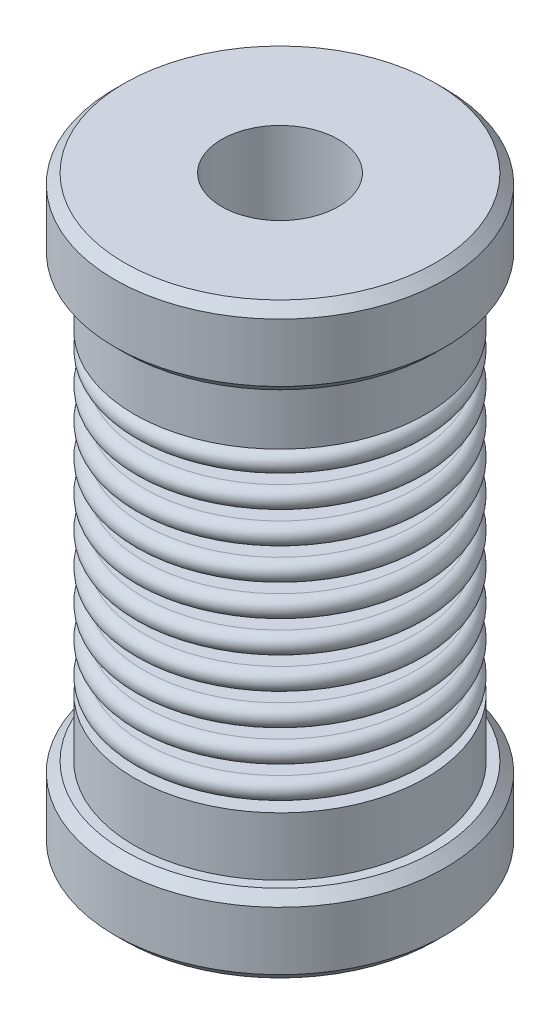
ISO-10303-21;
HEADER;
FILE_DESCRIPTION(('STEP AP214'),'2;1');
FILE_NAME('part.step','',(''),(''),'','','');
FILE_SCHEMA(('AUTOMOTIVE_DESIGN { 1 0 10303 214 1 1 1 1 }'));
ENDSEC;
DATA;
#1=APPLICATION_CONTEXT('core data for automotive mechanical design processes');
#2=APPLICATION_PROTOCOL_DEFINITION('international standard','automotive_design',2000,#1);
#3=PRODUCT_CONTEXT('',#1,'mechanical');
#4=PRODUCT('Part','Part','',(#3));
#5=PRODUCT_RELATED_PRODUCT_CATEGORY('part','',(#4));
#6=PRODUCT_DEFINITION_FORMATION('','',#4);
#7=PRODUCT_DEFINITION_CONTEXT('part definition',#1,'design');
#8=PRODUCT_DEFINITION('design','',#6,#7);
#9=PRODUCT_DEFINITION_SHAPE('','',#8);
#10=(LENGTH_UNIT() NAMED_UNIT(*) SI_UNIT(.MILLI.,.METRE.));
#11=(NAMED_UNIT(*) PLANE_ANGLE_UNIT() SI_UNIT($,.RADIAN.));
#12=(NAMED_UNIT(*) SI_UNIT($,.STERADIAN.) SOLID_ANGLE_UNIT());
#13=UNCERTAINTY_MEASURE_WITH_UNIT(LENGTH_MEASURE(1.E-05),#10,'distance_accuracy_value','');
#14=(GEOMETRIC_REPRESENTATION_CONTEXT(3) GLOBAL_UNCERTAINTY_ASSIGNED_CONTEXT((#13)) GLOBAL_UNIT_ASSIGNED_CONTEXT((#10,
#11,#12)) REPRESENTATION_CONTEXT('',''));
#15=CARTESIAN_POINT('',(0.,0.,0.));
#16=DIRECTION('',(0.,0.,1.));
#17=DIRECTION('',(1.,0.,0.));
#18=AXIS2_PLACEMENT_3D('',#15,#16,#17);
#19=CARTESIAN_POINT('',(0.,-34.7878737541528,0.));
#20=DIRECTION('',(0.,-1.,0.));
#21=DIRECTION('',(0.,0.,-1.));
#22=AXIS2_PLACEMENT_3D('',#19,#20,#21);
#23=CYLINDRICAL_SURFACE('',#22,5.5);
#24=CARTESIAN_POINT('',(0.,-21.27,0.));
#25=DIRECTION('',(0.,1.,0.));
#26=DIRECTION('',(0.,0.,1.));
#27=AXIS2_PLACEMENT_3D('',#24,#25,#26);
#28=CIRCLE('',#27,5.5);
#29=CARTESIAN_POINT('',(0.,-21.27,5.5));
#30=VERTEX_POINT('',#29);
#31=EDGE_CURVE('E184',#30,#30,#28,.T.);
#32=ORIENTED_EDGE('',*,*,#31,.F.);
#33=EDGE_LOOP('',(#32));
#34=FACE_BOUND('',#33,.T.);
#35=CARTESIAN_POINT('',(0.,-21.8900000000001,0.));
#36=DIRECTION('',(0.,1.,0.));
#37=DIRECTION('',(0.,0.,1.));
#38=AXIS2_PLACEMENT_3D('',#35,#36,#37);
#39=CIRCLE('',#38,5.5);
#40=CARTESIAN_POINT('',(0.,-21.8900000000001,5.5));
#41=VERTEX_POINT('',#40);
#42=EDGE_CURVE('E199',#41,#41,#39,.T.);
#43=ORIENTED_EDGE('',*,*,#42,.T.);
#44=EDGE_LOOP('',(#43));
#45=FACE_BOUND('',#44,.T.);
#46=ADVANCED_FACE('F26',(#34,#45),#23,.T.);
#47=CARTESIAN_POINT('',(0.,-23.2,0.));
#48=DIRECTION('',(0.,-1.,0.));
#49=DIRECTION('',(0.,0.,-1.));
#50=AXIS2_PLACEMENT_3D('',#47,#48,#49);
#51=CIRCLE('',#50,5.5);
#52=CARTESIAN_POINT('',(0.,-23.2,-5.5));
#53=VERTEX_POINT('',#52);
#54=EDGE_CURVE('E70',#53,#53,#51,.T.);
#55=ORIENTED_EDGE('',*,*,#54,.F.);
#56=EDGE_LOOP('',(#55));
#57=FACE_BOUND('',#56,.T.);
#58=CARTESIAN_POINT('',(0.,-22.8900000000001,0.));
#59=DIRECTION('',(0.,1.,0.));
#60=DIRECTION('',(0.,0.,1.));
#61=AXIS2_PLACEMENT_3D('',#58,#59,#60);
#62=CIRCLE('',#61,5.5);
#63=CARTESIAN_POINT('',(0.,-22.8900000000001,5.5));
#64=VERTEX_POINT('',#63);
#65=EDGE_CURVE('E196',#64,#64,#62,.T.);
#66=ORIENTED_EDGE('',*,*,#65,.F.);
#67=EDGE_LOOP('',(#66));
#68=FACE_BOUND('',#67,.T.);
#69=ADVANCED_FACE('F224',(#57,#68),#23,.T.);
#70=CARTESIAN_POINT('',(0.,-19.6500000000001,0.));
#71=DIRECTION('',(0.,1.,0.));
#72=DIRECTION('',(0.,0.,1.));
#73=AXIS2_PLACEMENT_3D('',#70,#71,#72);
#74=CIRCLE('',#73,5.5);
#75=CARTESIAN_POINT('',(0.,-19.6500000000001,5.5));
#76=VERTEX_POINT('',#75);
#77=EDGE_CURVE('E172',#76,#76,#74,.T.);
#78=ORIENTED_EDGE('',*,*,#77,.F.);
#79=EDGE_LOOP('',(#78));
#80=FACE_BOUND('',#79,.T.);
#81=CARTESIAN_POINT('',(0.,-20.27,0.));
#82=DIRECTION('',(0.,1.,0.));
#83=DIRECTION('',(0.,0.,1.));
#84=AXIS2_PLACEMENT_3D('',#81,#82,#83);
#85=CIRCLE('',#84,5.5);
#86=CARTESIAN_POINT('',(0.,-20.27,5.5));
#87=VERTEX_POINT('',#86);
#88=EDGE_CURVE('E187',#87,#87,#85,.T.);
#89=ORIENTED_EDGE('',*,*,#88,.T.);
#90=EDGE_LOOP('',(#89));
#91=FACE_BOUND('',#90,.T.);
#92=ADVANCED_FACE('F226',(#80,#91),#23,.T.);
#93=CARTESIAN_POINT('',(0.,-18.03,0.));
#94=DIRECTION('',(0.,1.,0.));
#95=DIRECTION('',(0.,0.,1.));
#96=AXIS2_PLACEMENT_3D('',#93,#94,#95);
#97=CIRCLE('',#96,5.5);
#98=CARTESIAN_POINT('',(0.,-18.03,5.5));
#99=VERTEX_POINT('',#98);
#100=EDGE_CURVE('E160',#99,#99,#97,.T.);
#101=ORIENTED_EDGE('',*,*,#100,.F.);
#102=EDGE_LOOP('',(#101));
#103=FACE_BOUND('',#102,.T.);
#104=CARTESIAN_POINT('',(0.,-18.6500000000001,0.));
#105=DIRECTION('',(0.,1.,0.));
#106=DIRECTION('',(0.,0.,1.));
#107=AXIS2_PLACEMENT_3D('',#104,#105,#106);
#108=CIRCLE('',#107,5.5);
#109=CARTESIAN_POINT('',(0.,-18.6500000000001,5.5));
#110=VERTEX_POINT('',#109);
#111=EDGE_CURVE('E175',#110,#110,#108,.T.);
#112=ORIENTED_EDGE('',*,*,#111,.T.);
#113=EDGE_LOOP('',(#112));
#114=FACE_BOUND('',#113,.T.);
#115=ADVANCED_FACE('F233',(#103,#114),#23,.T.);
#116=CARTESIAN_POINT('',(0.,-16.41,0.));
#117=DIRECTION('',(0.,1.,0.));
#118=DIRECTION('',(0.,0.,1.));
#119=AXIS2_PLACEMENT_3D('',#116,#117,#118);
#120=CIRCLE('',#119,5.5);
#121=CARTESIAN_POINT('',(0.,-16.41,5.5));
#122=VERTEX_POINT('',#121);
#123=EDGE_CURVE('E148',#122,#122,#120,.T.);
#124=ORIENTED_EDGE('',*,*,#123,.F.);
#125=EDGE_LOOP('',(#124));
#126=FACE_BOUND('',#125,.T.);
#127=CARTESIAN_POINT('',(0.,-17.03,0.));
#128=DIRECTION('',(0.,1.,0.));
#129=DIRECTION('',(0.,0.,1.));
#130=AXIS2_PLACEMENT_3D('',#127,#128,#129);
#131=CIRCLE('',#130,5.5);
#132=CARTESIAN_POINT('',(0.,-17.03,5.5));
#133=VERTEX_POINT('',#132);
#134=EDGE_CURVE('E163',#133,#133,#131,.T.);
#135=ORIENTED_EDGE('',*,*,#134,.T.);
#136=EDGE_LOOP('',(#135));
#137=FACE_BOUND('',#136,.T.);
#138=ADVANCED_FACE('F318',(#126,#137),#23,.T.);
#139=CARTESIAN_POINT('',(0.,-14.7900000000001,0.));
#140=DIRECTION('',(0.,1.,0.));
#141=DIRECTION('',(0.,0.,1.));
#142=AXIS2_PLACEMENT_3D('',#139,#140,#141);
#143=CIRCLE('',#142,5.5);
#144=CARTESIAN_POINT('',(0.,-14.7900000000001,5.5));
#145=VERTEX_POINT('',#144);
#146=EDGE_CURVE('E136',#145,#145,#143,.T.);
#147=ORIENTED_EDGE('',*,*,#146,.F.);
#148=EDGE_LOOP('',(#147));
#149=FACE_BOUND('',#148,.T.);
#150=CARTESIAN_POINT('',(0.,-15.41,0.));
#151=DIRECTION('',(0.,1.,0.));
#152=DIRECTION('',(0.,0.,1.));
#153=AXIS2_PLACEMENT_3D('',#150,#151,#152);
#154=CIRCLE('',#153,5.5);
#155=CARTESIAN_POINT('',(0.,-15.41,5.5));
#156=VERTEX_POINT('',#155);
#157=EDGE_CURVE('E151',#156,#156,#154,.T.);
#158=ORIENTED_EDGE('',*,*,#157,.T.);
#159=EDGE_LOOP('',(#158));
#160=FACE_BOUND('',#159,.T.);
#161=ADVANCED_FACE('F311',(#149,#160),#23,.T.);
#162=CARTESIAN_POINT('',(0.,-13.17,0.));
#163=DIRECTION('',(0.,1.,0.));
#164=DIRECTION('',(0.,0.,1.));
#165=AXIS2_PLACEMENT_3D('',#162,#163,#164);
#166=CIRCLE('',#165,5.5);
#167=CARTESIAN_POINT('',(0.,-13.17,5.5));
#168=VERTEX_POINT('',#167);
#169=EDGE_CURVE('E124',#168,#168,#166,.T.);
#170=ORIENTED_EDGE('',*,*,#169,.F.);
#171=EDGE_LOOP('',(#170));
#172=FACE_BOUND('',#171,.T.);
#173=CARTESIAN_POINT('',(0.,-13.7900000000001,0.));
#174=DIRECTION('',(0.,1.,0.));
#175=DIRECTION('',(0.,0.,1.));
#176=AXIS2_PLACEMENT_3D('',#173,#174,#175);
#177=CIRCLE('',#176,5.5);
#178=CARTESIAN_POINT('',(0.,-13.7900000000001,5.5));
#179=VERTEX_POINT('',#178);
#180=EDGE_CURVE('E139',#179,#179,#177,.T.);
#181=ORIENTED_EDGE('',*,*,#180,.T.);
#182=EDGE_LOOP('',(#181));
#183=FACE_BOUND('',#182,.T.);
#184=ADVANCED_FACE('F304',(#172,#183),#23,.T.);
#185=CARTESIAN_POINT('',(0.,-11.5500000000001,0.));
#186=DIRECTION('',(0.,1.,0.));
#187=DIRECTION('',(0.,0.,1.));
#188=AXIS2_PLACEMENT_3D('',#185,#186,#187);
#189=CIRCLE('',#188,5.5);
#190=CARTESIAN_POINT('',(0.,-11.5500000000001,5.5));
#191=VERTEX_POINT('',#190);
#192=EDGE_CURVE('E112',#191,#191,#189,.T.);
#193=ORIENTED_EDGE('',*,*,#192,.F.);
#194=EDGE_LOOP('',(#193));
#195=FACE_BOUND('',#194,.T.);
#196=CARTESIAN_POINT('',(0.,-12.17,0.));
#197=DIRECTION('',(0.,1.,0.));
#198=DIRECTION('',(0.,0.,1.));
#199=AXIS2_PLACEMENT_3D('',#196,#197,#198);
#200=CIRCLE('',#199,5.5);
#201=CARTESIAN_POINT('',(0.,-12.17,5.5));
#202=VERTEX_POINT('',#201);
#203=EDGE_CURVE('E127',#202,#202,#200,.T.);
#204=ORIENTED_EDGE('',*,*,#203,.T.);
#205=EDGE_LOOP('',(#204));
#206=FACE_BOUND('',#205,.T.);
#207=ADVANCED_FACE('F297',(#195,#206),#23,.T.);
#208=CARTESIAN_POINT('',(0.,-9.92999999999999,0.));
#209=DIRECTION('',(0.,1.,0.));
#210=DIRECTION('',(0.,0.,1.));
#211=AXIS2_PLACEMENT_3D('',#208,#209,#210);
#212=CIRCLE('',#211,5.5);
#213=CARTESIAN_POINT('',(0.,-9.92999999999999,5.5));
#214=VERTEX_POINT('',#213);
#215=EDGE_CURVE('E100',#214,#214,#212,.T.);
#216=ORIENTED_EDGE('',*,*,#215,.F.);
#217=EDGE_LOOP('',(#216));
#218=FACE_BOUND('',#217,.T.);
#219=CARTESIAN_POINT('',(0.,-10.5500000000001,0.));
#220=DIRECTION('',(0.,1.,0.));
#221=DIRECTION('',(0.,0.,1.));
#222=AXIS2_PLACEMENT_3D('',#219,#220,#221);
#223=CIRCLE('',#222,5.5);
#224=CARTESIAN_POINT('',(0.,-10.5500000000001,5.5));
#225=VERTEX_POINT('',#224);
#226=EDGE_CURVE('E115',#225,#225,#223,.T.);
#227=ORIENTED_EDGE('',*,*,#226,.T.);
#228=EDGE_LOOP('',(#227));
#229=FACE_BOUND('',#228,.T.);
#230=ADVANCED_FACE('F289',(#218,#229),#23,.T.);
#231=CARTESIAN_POINT('',(0.,-8.31000000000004,0.));
#232=DIRECTION('',(0.,1.,0.));
#233=DIRECTION('',(0.,0.,1.));
#234=AXIS2_PLACEMENT_3D('',#231,#232,#233);
#235=CIRCLE('',#234,5.5);
#236=CARTESIAN_POINT('',(0.,-8.31000000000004,5.5));
#237=VERTEX_POINT('',#236);
#238=EDGE_CURVE('E88',#237,#237,#235,.T.);
#239=ORIENTED_EDGE('',*,*,#238,.F.);
#240=EDGE_LOOP('',(#239));
#241=FACE_BOUND('',#240,.T.);
#242=CARTESIAN_POINT('',(0.,-8.92999999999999,0.));
#243=DIRECTION('',(0.,1.,0.));
#244=DIRECTION('',(0.,0.,1.));
#245=AXIS2_PLACEMENT_3D('',#242,#243,#244);
#246=CIRCLE('',#245,5.5);
#247=CARTESIAN_POINT('',(0.,-8.92999999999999,5.5));
#248=VERTEX_POINT('',#247);
#249=EDGE_CURVE('E103',#248,#248,#246,.T.);
#250=ORIENTED_EDGE('',*,*,#249,.T.);
#251=EDGE_LOOP('',(#250));
#252=FACE_BOUND('',#251,.T.);
#253=ADVANCED_FACE('F241',(#241,#252),#23,.T.);
#254=CARTESIAN_POINT('',(0.,-7.00000000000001,0.));
#255=DIRECTION('',(0.,-1.,0.));
#256=DIRECTION('',(0.,0.,-1.));
#257=AXIS2_PLACEMENT_3D('',#254,#255,#256);
#258=CIRCLE('',#257,5.5);
#259=CARTESIAN_POINT('',(0.,-7.00000000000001,-5.5));
#260=VERTEX_POINT('',#259);
#261=EDGE_CURVE('E73',#260,#260,#258,.T.);
#262=ORIENTED_EDGE('',*,*,#261,.T.);
#263=EDGE_LOOP('',(#262));
#264=FACE_BOUND('',#263,.T.);
#265=CARTESIAN_POINT('',(0.,-7.31000000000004,0.));
#266=DIRECTION('',(0.,1.,0.));
#267=DIRECTION('',(0.,0.,1.));
#268=AXIS2_PLACEMENT_3D('',#265,#266,#267);
#269=CIRCLE('',#268,5.5);
#270=CARTESIAN_POINT('',(0.,-7.31000000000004,5.5));
#271=VERTEX_POINT('',#270);
#272=EDGE_CURVE('E91',#271,#271,#269,.T.);
#273=ORIENTED_EDGE('',*,*,#272,.T.);
#274=EDGE_LOOP('',(#273));
#275=FACE_BOUND('',#274,.T.);
#276=ADVANCED_FACE('F236',(#264,#275),#23,.T.);
#277=CARTESIAN_POINT('',(8.50000000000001,0.,0.));
#278=DIRECTION('',(0.,1.,0.));
#279=DIRECTION('',(0.,0.,1.));
#280=AXIS2_PLACEMENT_3D('',#277,#278,#279);
#281=PLANE('',#280);
#282=CARTESIAN_POINT('',(0.,0.,0.));
#283=DIRECTION('',(0.,1.,0.));
#284=DIRECTION('',(0.,0.,1.));
#285=AXIS2_PLACEMENT_3D('',#282,#283,#284);
#286=CIRCLE('',#285,8.);
#287=CARTESIAN_POINT('',(0.,0.,8.));
#288=VERTEX_POINT('',#287);
#289=EDGE_CURVE('E10',#288,#288,#286,.T.);
#290=ORIENTED_EDGE('',*,*,#289,.T.);
#291=EDGE_LOOP('',(#290));
#292=FACE_BOUND('',#291,.T.);
#293=CARTESIAN_POINT('',(0.,0.,0.));
#294=DIRECTION('',(0.,-1.,0.));
#295=DIRECTION('',(0.,0.,-1.));
#296=AXIS2_PLACEMENT_3D('',#293,#294,#295);
#297=CIRCLE('',#296,3.);
#298=CARTESIAN_POINT('',(0.,0.,-3.));
#299=VERTEX_POINT('',#298);
#300=EDGE_CURVE('E58',#299,#299,#297,.T.);
#301=ORIENTED_EDGE('',*,*,#300,.T.);
#302=EDGE_LOOP('',(#301));
#303=FACE_BOUND('',#302,.T.);
#304=ADVANCED_FACE('F28',(#292,#303),#281,.T.);
#305=CARTESIAN_POINT('',(0.,-34.7878737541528,0.));
#306=DIRECTION('',(0.,-1.,0.));
#307=DIRECTION('',(0.,0.,-1.));
#308=AXIS2_PLACEMENT_3D('',#305,#306,#307);
#309=CYLINDRICAL_SURFACE('',#308,3.);
#310=CARTESIAN_POINT('',(0.,-30.2,0.));
#311=DIRECTION('',(0.,-1.,0.));
#312=DIRECTION('',(0.,0.,-1.));
#313=AXIS2_PLACEMENT_3D('',#310,#311,#312);
#314=CIRCLE('',#313,3.);
#315=CARTESIAN_POINT('',(0.,-30.2,-3.));
#316=VERTEX_POINT('',#315);
#317=EDGE_CURVE('E61',#316,#316,#314,.T.);
#318=ORIENTED_EDGE('',*,*,#317,.T.);
#319=EDGE_LOOP('',(#318));
#320=FACE_BOUND('',#319,.T.);
#321=ORIENTED_EDGE('',*,*,#300,.F.);
#322=EDGE_LOOP('',(#321));
#323=FACE_BOUND('',#322,.T.);
#324=ADVANCED_FACE('F263',(#320,#323),#309,.F.);
#325=CARTESIAN_POINT('',(3.,-30.2,0.));
#326=DIRECTION('',(0.,-1.,0.));
#327=DIRECTION('',(0.,0.,-1.));
#328=AXIS2_PLACEMENT_3D('',#325,#326,#327);
#329=PLANE('',#328);
#330=CARTESIAN_POINT('',(0.,-30.2,0.));
#331=DIRECTION('',(0.,-1.,0.));
#332=DIRECTION('',(0.,0.,-1.));
#333=AXIS2_PLACEMENT_3D('',#330,#331,#332);
#334=CIRCLE('',#333,7.99999999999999);
#335=CARTESIAN_POINT('',(0.,-30.2,-7.99999999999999));
#336=VERTEX_POINT('',#335);
#337=EDGE_CURVE('E55',#336,#336,#334,.T.);
#338=ORIENTED_EDGE('',*,*,#337,.T.);
#339=EDGE_LOOP('',(#338));
#340=FACE_BOUND('',#339,.T.);
#341=ORIENTED_EDGE('',*,*,#317,.F.);
#342=EDGE_LOOP('',(#341));
#343=FACE_BOUND('',#342,.T.);
#344=ADVANCED_FACE('F260',(#340,#343),#329,.T.);
#345=CARTESIAN_POINT('',(0.,-34.7878737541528,0.));
#346=DIRECTION('',(0.,-1.,0.));
#347=DIRECTION('',(0.,0.,-1.));
#348=AXIS2_PLACEMENT_3D('',#345,#346,#347);
#349=CYLINDRICAL_SURFACE('',#348,8.5);
#350=CARTESIAN_POINT('',(0.,-29.7,0.));
#351=DIRECTION('',(0.,-1.,0.));
#352=DIRECTION('',(0.,0.,-1.));
#353=AXIS2_PLACEMENT_3D('',#350,#351,#352);
#354=CIRCLE('',#353,8.5);
#355=CARTESIAN_POINT('',(0.,-29.7,-8.5));
#356=VERTEX_POINT('',#355);
#357=EDGE_CURVE('E49',#356,#356,#354,.F.);
#358=ORIENTED_EDGE('',*,*,#357,.T.);
#359=EDGE_LOOP('',(#358));
#360=FACE_BOUND('',#359,.T.);
#361=CARTESIAN_POINT('',(0.,-26.7000000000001,0.));
#362=DIRECTION('',(0.,1.,0.));
#363=DIRECTION('',(0.,0.,1.));
#364=AXIS2_PLACEMENT_3D('',#361,#362,#363);
#365=CIRCLE('',#364,8.5);
#366=CARTESIAN_POINT('',(0.,-26.7000000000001,8.5));
#367=VERTEX_POINT('',#366);
#368=EDGE_CURVE('E52',#367,#367,#365,.F.);
#369=ORIENTED_EDGE('',*,*,#368,.T.);
#370=EDGE_LOOP('',(#369));
#371=FACE_BOUND('',#370,.T.);
#372=ADVANCED_FACE('F256',(#360,#371),#349,.T.);
#373=CARTESIAN_POINT('',(8.50000000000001,-26.2,0.));
#374=DIRECTION('',(0.,1.,0.));
#375=DIRECTION('',(0.,0.,1.));
#376=AXIS2_PLACEMENT_3D('',#373,#374,#375);
#377=PLANE('',#376);
#378=CARTESIAN_POINT('',(0.,-26.2,0.));
#379=DIRECTION('',(0.,1.,0.));
#380=DIRECTION('',(0.,0.,1.));
#381=AXIS2_PLACEMENT_3D('',#378,#379,#380);
#382=CIRCLE('',#381,8.);
#383=CARTESIAN_POINT('',(0.,-26.2,8.));
#384=VERTEX_POINT('',#383);
#385=EDGE_CURVE('E46',#384,#384,#382,.T.);
#386=ORIENTED_EDGE('',*,*,#385,.T.);
#387=EDGE_LOOP('',(#386));
#388=FACE_BOUND('',#387,.T.);
#389=CARTESIAN_POINT('',(0.,-26.2,0.));
#390=DIRECTION('',(0.,-1.,0.));
#391=DIRECTION('',(0.,0.,-1.));
#392=AXIS2_PLACEMENT_3D('',#389,#390,#391);
#393=CIRCLE('',#392,7.5);
#394=CARTESIAN_POINT('',(0.,-26.2,-7.5));
#395=VERTEX_POINT('',#394);
#396=EDGE_CURVE('E64',#395,#395,#393,.T.);
#397=ORIENTED_EDGE('',*,*,#396,.T.);
#398=EDGE_LOOP('',(#397));
#399=FACE_BOUND('',#398,.T.);
#400=ADVANCED_FACE('F252',(#388,#399),#377,.T.);
#401=CARTESIAN_POINT('',(0.,-34.7878737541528,0.));
#402=DIRECTION('',(0.,-1.,0.));
#403=DIRECTION('',(0.,0.,-1.));
#404=AXIS2_PLACEMENT_3D('',#401,#402,#403);
#405=CYLINDRICAL_SURFACE('',#404,7.5);
#406=CARTESIAN_POINT('',(0.,-23.2,0.));
#407=DIRECTION('',(0.,-1.,0.));
#408=DIRECTION('',(0.,0.,-1.));
#409=AXIS2_PLACEMENT_3D('',#406,#407,#408);
#410=CIRCLE('',#409,7.5);
#411=CARTESIAN_POINT('',(0.,-23.2,-7.5));
#412=VERTEX_POINT('',#411);
#413=EDGE_CURVE('E67',#412,#412,#410,.T.);
#414=ORIENTED_EDGE('',*,*,#413,.T.);
#415=EDGE_LOOP('',(#414));
#416=FACE_BOUND('',#415,.T.);
#417=ORIENTED_EDGE('',*,*,#396,.F.);
#418=EDGE_LOOP('',(#417));
#419=FACE_BOUND('',#418,.T.);
#420=ADVANCED_FACE('F248',(#416,#419),#405,.T.);
#421=CARTESIAN_POINT('',(7.50000000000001,-23.2,0.));
#422=DIRECTION('',(0.,1.,0.));
#423=DIRECTION('',(0.,0.,1.));
#424=AXIS2_PLACEMENT_3D('',#421,#422,#423);
#425=PLANE('',#424);
#426=ORIENTED_EDGE('',*,*,#54,.T.);
#427=EDGE_LOOP('',(#426));
#428=FACE_BOUND('',#427,.T.);
#429=ORIENTED_EDGE('',*,*,#413,.F.);
#430=EDGE_LOOP('',(#429));
#431=FACE_BOUND('',#430,.T.);
#432=ADVANCED_FACE('F245',(#428,#431),#425,.T.);
#433=CARTESIAN_POINT('',(5.50000000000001,-7.00000000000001,0.));
#434=DIRECTION('',(0.,-1.,0.));
#435=DIRECTION('',(0.,0.,-1.));
#436=AXIS2_PLACEMENT_3D('',#433,#434,#435);
#437=PLANE('',#436);
#438=CARTESIAN_POINT('',(0.,-7.00000000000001,0.));
#439=DIRECTION('',(0.,-1.,0.));
#440=DIRECTION('',(0.,0.,-1.));
#441=AXIS2_PLACEMENT_3D('',#438,#439,#440);
#442=CIRCLE('',#441,7.5);
#443=CARTESIAN_POINT('',(0.,-7.00000000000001,-7.5));
#444=VERTEX_POINT('',#443);
#445=EDGE_CURVE('E76',#444,#444,#442,.T.);
#446=ORIENTED_EDGE('',*,*,#445,.T.);
#447=EDGE_LOOP('',(#446));
#448=FACE_BOUND('',#447,.T.);
#449=ORIENTED_EDGE('',*,*,#261,.F.);
#450=EDGE_LOOP('',(#449));
#451=FACE_BOUND('',#450,.T.);
#452=ADVANCED_FACE('F243',(#448,#451),#437,.T.);
#453=CARTESIAN_POINT('',(0.,-34.7878737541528,0.));
#454=DIRECTION('',(0.,-1.,0.));
#455=DIRECTION('',(0.,0.,-1.));
#456=AXIS2_PLACEMENT_3D('',#453,#454,#455);
#457=CYLINDRICAL_SURFACE('',#456,7.5);
#458=CARTESIAN_POINT('',(0.,-4.,0.));
#459=DIRECTION('',(0.,-1.,0.));
#460=DIRECTION('',(0.,0.,-1.));
#461=AXIS2_PLACEMENT_3D('',#458,#459,#460);
#462=CIRCLE('',#461,7.5);
#463=CARTESIAN_POINT('',(0.,-4.,-7.5));
#464=VERTEX_POINT('',#463);
#465=EDGE_CURVE('E79',#464,#464,#462,.T.);
#466=ORIENTED_EDGE('',*,*,#465,.T.);
#467=EDGE_LOOP('',(#466));
#468=FACE_BOUND('',#467,.T.);
#469=ORIENTED_EDGE('',*,*,#445,.F.);
#470=EDGE_LOOP('',(#469));
#471=FACE_BOUND('',#470,.T.);
#472=ADVANCED_FACE('F596',(#468,#471),#457,.T.);
#473=CARTESIAN_POINT('',(7.50000000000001,-4.,0.));
#474=DIRECTION('',(0.,-1.,0.));
#475=DIRECTION('',(0.,0.,-1.));
#476=AXIS2_PLACEMENT_3D('',#473,#474,#475);
#477=PLANE('',#476);
#478=CARTESIAN_POINT('',(0.,-4.,0.));
#479=DIRECTION('',(0.,-1.,0.));
#480=DIRECTION('',(0.,0.,-1.));
#481=AXIS2_PLACEMENT_3D('',#478,#479,#480);
#482=CIRCLE('',#481,8.);
#483=CARTESIAN_POINT('',(0.,-4.,-8.));
#484=VERTEX_POINT('',#483);
#485=EDGE_CURVE('E41',#484,#484,#482,.T.);
#486=ORIENTED_EDGE('',*,*,#485,.T.);
#487=EDGE_LOOP('',(#486));
#488=FACE_BOUND('',#487,.T.);
#489=ORIENTED_EDGE('',*,*,#465,.F.);
#490=EDGE_LOOP('',(#489));
#491=FACE_BOUND('',#490,.T.);
#492=ADVANCED_FACE('F594',(#488,#491),#477,.T.);
#493=CARTESIAN_POINT('',(0.,-34.7878737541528,0.));
#494=DIRECTION('',(0.,-1.,0.));
#495=DIRECTION('',(0.,0.,-1.));
#496=AXIS2_PLACEMENT_3D('',#493,#494,#495);
#497=CYLINDRICAL_SURFACE('',#496,8.5);
#498=CARTESIAN_POINT('',(0.,-3.50000000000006,0.));
#499=DIRECTION('',(0.,-1.,0.));
#500=DIRECTION('',(0.,0.,-1.));
#501=AXIS2_PLACEMENT_3D('',#498,#499,#500);
#502=CIRCLE('',#501,8.5);
#503=CARTESIAN_POINT('',(0.,-3.50000000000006,-8.5));
#504=VERTEX_POINT('',#503);
#505=EDGE_CURVE('E33',#504,#504,#502,.F.);
#506=ORIENTED_EDGE('',*,*,#505,.T.);
#507=EDGE_LOOP('',(#506));
#508=FACE_BOUND('',#507,.T.);
#509=CARTESIAN_POINT('',(0.,-0.499999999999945,0.));
#510=DIRECTION('',(0.,1.,0.));
#511=DIRECTION('',(0.,0.,1.));
#512=AXIS2_PLACEMENT_3D('',#509,#510,#511);
#513=CIRCLE('',#512,8.5);
#514=CARTESIAN_POINT('',(0.,-0.499999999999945,8.5));
#515=VERTEX_POINT('',#514);
#516=EDGE_CURVE('E37',#515,#515,#513,.F.);
#517=ORIENTED_EDGE('',*,*,#516,.T.);
#518=EDGE_LOOP('',(#517));
#519=FACE_BOUND('',#518,.T.);
#520=ADVANCED_FACE('F590',(#508,#519),#497,.T.);
#521=CARTESIAN_POINT('',(0.,-7.31000000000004,-5.5));
#522=DIRECTION('',(0.,-1.,0.));
#523=DIRECTION('',(0.,0.,-1.));
#524=AXIS2_PLACEMENT_3D('',#521,#522,#523);
#525=PLANE('',#524);
#526=ORIENTED_EDGE('',*,*,#272,.F.);
#527=EDGE_LOOP('',(#526));
#528=FACE_BOUND('',#527,.T.);
#529=CARTESIAN_POINT('',(0.,-7.31000000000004,0.));
#530=DIRECTION('',(0.,1.,0.));
#531=DIRECTION('',(0.,0.,1.));
#532=AXIS2_PLACEMENT_3D('',#529,#530,#531);
#533=CIRCLE('',#532,7.);
#534=CARTESIAN_POINT('',(0.,-7.31000000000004,7.));
#535=VERTEX_POINT('',#534);
#536=EDGE_CURVE('E82',#535,#535,#533,.T.);
#537=ORIENTED_EDGE('',*,*,#536,.T.);
#538=EDGE_LOOP('',(#537));
#539=FACE_BOUND('',#538,.T.);
#540=ADVANCED_FACE('F586',(#528,#539),#525,.F.);
#541=CARTESIAN_POINT('',(0.,-7.80999999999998,0.));
#542=DIRECTION('',(0.,1.,0.));
#543=DIRECTION('',(0.,0.,1.));
#544=AXIS2_PLACEMENT_3D('',#541,#542,#543);
#545=TOROIDAL_SURFACE('',#544,7.,0.5);
#546=ORIENTED_EDGE('',*,*,#536,.F.);
#547=EDGE_LOOP('',(#546));
#548=FACE_BOUND('',#547,.T.);
#549=CARTESIAN_POINT('',(0.,-8.31000000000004,0.));
#550=DIRECTION('',(0.,1.,0.));
#551=DIRECTION('',(0.,0.,1.));
#552=AXIS2_PLACEMENT_3D('',#549,#550,#551);
#553=CIRCLE('',#552,7.);
#554=CARTESIAN_POINT('',(0.,-8.31000000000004,7.));
#555=VERTEX_POINT('',#554);
#556=EDGE_CURVE('E85',#555,#555,#553,.T.);
#557=ORIENTED_EDGE('',*,*,#556,.T.);
#558=EDGE_LOOP('',(#557));
#559=FACE_BOUND('',#558,.T.);
#560=ADVANCED_FACE('F582',(#548,#559),#545,.T.);
#561=CARTESIAN_POINT('',(0.,-8.31000000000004,-5.5));
#562=DIRECTION('',(0.,1.,0.));
#563=DIRECTION('',(0.,0.,1.));
#564=AXIS2_PLACEMENT_3D('',#561,#562,#563);
#565=PLANE('',#564);
#566=ORIENTED_EDGE('',*,*,#556,.F.);
#567=EDGE_LOOP('',(#566));
#568=FACE_BOUND('',#567,.T.);
#569=ORIENTED_EDGE('',*,*,#238,.T.);
#570=EDGE_LOOP('',(#569));
#571=FACE_BOUND('',#570,.T.);
#572=ADVANCED_FACE('F350',(#568,#571),#565,.F.);
#573=CARTESIAN_POINT('',(0.,-8.92999999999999,-5.5));
#574=DIRECTION('',(0.,-1.,0.));
#575=DIRECTION('',(0.,0.,-1.));
#576=AXIS2_PLACEMENT_3D('',#573,#574,#575);
#577=PLANE('',#576);
#578=ORIENTED_EDGE('',*,*,#249,.F.);
#579=EDGE_LOOP('',(#578));
#580=FACE_BOUND('',#579,.T.);
#581=CARTESIAN_POINT('',(0.,-8.92999999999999,0.));
#582=DIRECTION('',(0.,1.,0.));
#583=DIRECTION('',(0.,0.,1.));
#584=AXIS2_PLACEMENT_3D('',#581,#582,#583);
#585=CIRCLE('',#584,7.);
#586=CARTESIAN_POINT('',(0.,-8.92999999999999,7.));
#587=VERTEX_POINT('',#586);
#588=EDGE_CURVE('E94',#587,#587,#585,.T.);
#589=ORIENTED_EDGE('',*,*,#588,.T.);
#590=EDGE_LOOP('',(#589));
#591=FACE_BOUND('',#590,.T.);
#592=ADVANCED_FACE('F344',(#580,#591),#577,.F.);
#593=CARTESIAN_POINT('',(0.,-9.43000000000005,0.));
#594=DIRECTION('',(0.,1.,0.));
#595=DIRECTION('',(0.,0.,1.));
#596=AXIS2_PLACEMENT_3D('',#593,#594,#595);
#597=TOROIDAL_SURFACE('',#596,7.,0.5);
#598=ORIENTED_EDGE('',*,*,#588,.F.);
#599=EDGE_LOOP('',(#598));
#600=FACE_BOUND('',#599,.T.);
#601=CARTESIAN_POINT('',(0.,-9.92999999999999,0.));
#602=DIRECTION('',(0.,1.,0.));
#603=DIRECTION('',(0.,0.,1.));
#604=AXIS2_PLACEMENT_3D('',#601,#602,#603);
#605=CIRCLE('',#604,7.);
#606=CARTESIAN_POINT('',(0.,-9.92999999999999,7.));
#607=VERTEX_POINT('',#606);
#608=EDGE_CURVE('E97',#607,#607,#605,.T.);
#609=ORIENTED_EDGE('',*,*,#608,.T.);
#610=EDGE_LOOP('',(#609));
#611=FACE_BOUND('',#610,.T.);
#612=ADVANCED_FACE('F349',(#600,#611),#597,.T.);
#613=CARTESIAN_POINT('',(0.,-9.92999999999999,-5.5));
#614=DIRECTION('',(0.,1.,0.));
#615=DIRECTION('',(0.,0.,1.));
#616=AXIS2_PLACEMENT_3D('',#613,#614,#615);
#617=PLANE('',#616);
#618=ORIENTED_EDGE('',*,*,#608,.F.);
#619=EDGE_LOOP('',(#618));
#620=FACE_BOUND('',#619,.T.);
#621=ORIENTED_EDGE('',*,*,#215,.T.);
#622=EDGE_LOOP('',(#621));
#623=FACE_BOUND('',#622,.T.);
#624=ADVANCED_FACE('F359',(#620,#623),#617,.F.);
#625=CARTESIAN_POINT('',(0.,-10.5500000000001,-5.5));
#626=DIRECTION('',(0.,-1.,0.));
#627=DIRECTION('',(0.,0.,-1.));
#628=AXIS2_PLACEMENT_3D('',#625,#626,#627);
#629=PLANE('',#628);
#630=ORIENTED_EDGE('',*,*,#226,.F.);
#631=EDGE_LOOP('',(#630));
#632=FACE_BOUND('',#631,.T.);
#633=CARTESIAN_POINT('',(0.,-10.5500000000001,0.));
#634=DIRECTION('',(0.,1.,0.));
#635=DIRECTION('',(0.,0.,1.));
#636=AXIS2_PLACEMENT_3D('',#633,#634,#635);
#637=CIRCLE('',#636,7.);
#638=CARTESIAN_POINT('',(0.,-10.5500000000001,7.));
#639=VERTEX_POINT('',#638);
#640=EDGE_CURVE('E106',#639,#639,#637,.T.);
#641=ORIENTED_EDGE('',*,*,#640,.T.);
#642=EDGE_LOOP('',(#641));
#643=FACE_BOUND('',#642,.T.);
#644=ADVANCED_FACE('F367',(#632,#643),#629,.F.);
#645=CARTESIAN_POINT('',(0.,-11.05,0.));
#646=DIRECTION('',(0.,1.,0.));
#647=DIRECTION('',(0.,0.,1.));
#648=AXIS2_PLACEMENT_3D('',#645,#646,#647);
#649=TOROIDAL_SURFACE('',#648,7.,0.5);
#650=ORIENTED_EDGE('',*,*,#640,.F.);
#651=EDGE_LOOP('',(#650));
#652=FACE_BOUND('',#651,.T.);
#653=CARTESIAN_POINT('',(0.,-11.5500000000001,0.));
#654=DIRECTION('',(0.,1.,0.));
#655=DIRECTION('',(0.,0.,1.));
#656=AXIS2_PLACEMENT_3D('',#653,#654,#655);
#657=CIRCLE('',#656,7.);
#658=CARTESIAN_POINT('',(0.,-11.5500000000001,7.));
#659=VERTEX_POINT('',#658);
#660=EDGE_CURVE('E109',#659,#659,#657,.T.);
#661=ORIENTED_EDGE('',*,*,#660,.T.);
#662=EDGE_LOOP('',(#661));
#663=FACE_BOUND('',#662,.T.);
#664=ADVANCED_FACE('F375',(#652,#663),#649,.T.);
#665=CARTESIAN_POINT('',(0.,-11.5500000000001,-5.5));
#666=DIRECTION('',(0.,1.,0.));
#667=DIRECTION('',(0.,0.,1.));
#668=AXIS2_PLACEMENT_3D('',#665,#666,#667);
#669=PLANE('',#668);
#670=ORIENTED_EDGE('',*,*,#660,.F.);
#671=EDGE_LOOP('',(#670));
#672=FACE_BOUND('',#671,.T.);
#673=ORIENTED_EDGE('',*,*,#192,.T.);
#674=EDGE_LOOP('',(#673));
#675=FACE_BOUND('',#674,.T.);
#676=ADVANCED_FACE('F383',(#672,#675),#669,.F.);
#677=CARTESIAN_POINT('',(0.,-12.17,-5.5));
#678=DIRECTION('',(0.,-1.,0.));
#679=DIRECTION('',(0.,0.,-1.));
#680=AXIS2_PLACEMENT_3D('',#677,#678,#679);
#681=PLANE('',#680);
#682=ORIENTED_EDGE('',*,*,#203,.F.);
#683=EDGE_LOOP('',(#682));
#684=FACE_BOUND('',#683,.T.);
#685=CARTESIAN_POINT('',(0.,-12.17,0.));
#686=DIRECTION('',(0.,1.,0.));
#687=DIRECTION('',(0.,0.,1.));
#688=AXIS2_PLACEMENT_3D('',#685,#686,#687);
#689=CIRCLE('',#688,7.);
#690=CARTESIAN_POINT('',(0.,-12.17,7.));
#691=VERTEX_POINT('',#690);
#692=EDGE_CURVE('E118',#691,#691,#689,.T.);
#693=ORIENTED_EDGE('',*,*,#692,.T.);
#694=EDGE_LOOP('',(#693));
#695=FACE_BOUND('',#694,.T.);
#696=ADVANCED_FACE('F391',(#684,#695),#681,.F.);
#697=CARTESIAN_POINT('',(0.,-12.6700000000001,0.));
#698=DIRECTION('',(0.,1.,0.));
#699=DIRECTION('',(0.,0.,1.));
#700=AXIS2_PLACEMENT_3D('',#697,#698,#699);
#701=TOROIDAL_SURFACE('',#700,7.,0.5);
#702=ORIENTED_EDGE('',*,*,#692,.F.);
#703=EDGE_LOOP('',(#702));
#704=FACE_BOUND('',#703,.T.);
#705=CARTESIAN_POINT('',(0.,-13.17,0.));
#706=DIRECTION('',(0.,1.,0.));
#707=DIRECTION('',(0.,0.,1.));
#708=AXIS2_PLACEMENT_3D('',#705,#706,#707);
#709=CIRCLE('',#708,7.);
#710=CARTESIAN_POINT('',(0.,-13.17,7.));
#711=VERTEX_POINT('',#710);
#712=EDGE_CURVE('E121',#711,#711,#709,.T.);
#713=ORIENTED_EDGE('',*,*,#712,.T.);
#714=EDGE_LOOP('',(#713));
#715=FACE_BOUND('',#714,.T.);
#716=ADVANCED_FACE('F399',(#704,#715),#701,.T.);
#717=CARTESIAN_POINT('',(0.,-13.17,-5.5));
#718=DIRECTION('',(0.,1.,0.));
#719=DIRECTION('',(0.,0.,1.));
#720=AXIS2_PLACEMENT_3D('',#717,#718,#719);
#721=PLANE('',#720);
#722=ORIENTED_EDGE('',*,*,#712,.F.);
#723=EDGE_LOOP('',(#722));
#724=FACE_BOUND('',#723,.T.);
#725=ORIENTED_EDGE('',*,*,#169,.T.);
#726=EDGE_LOOP('',(#725));
#727=FACE_BOUND('',#726,.T.);
#728=ADVANCED_FACE('F407',(#724,#727),#721,.F.);
#729=CARTESIAN_POINT('',(0.,-13.7900000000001,-5.5));
#730=DIRECTION('',(0.,-1.,0.));
#731=DIRECTION('',(0.,0.,-1.));
#732=AXIS2_PLACEMENT_3D('',#729,#730,#731);
#733=PLANE('',#732);
#734=ORIENTED_EDGE('',*,*,#180,.F.);
#735=EDGE_LOOP('',(#734));
#736=FACE_BOUND('',#735,.T.);
#737=CARTESIAN_POINT('',(0.,-13.7900000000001,0.));
#738=DIRECTION('',(0.,1.,0.));
#739=DIRECTION('',(0.,0.,1.));
#740=AXIS2_PLACEMENT_3D('',#737,#738,#739);
#741=CIRCLE('',#740,7.);
#742=CARTESIAN_POINT('',(0.,-13.7900000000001,7.));
#743=VERTEX_POINT('',#742);
#744=EDGE_CURVE('E130',#743,#743,#741,.T.);
#745=ORIENTED_EDGE('',*,*,#744,.T.);
#746=EDGE_LOOP('',(#745));
#747=FACE_BOUND('',#746,.T.);
#748=ADVANCED_FACE('F415',(#736,#747),#733,.F.);
#749=CARTESIAN_POINT('',(0.,-14.29,0.));
#750=DIRECTION('',(0.,1.,0.));
#751=DIRECTION('',(0.,0.,1.));
#752=AXIS2_PLACEMENT_3D('',#749,#750,#751);
#753=TOROIDAL_SURFACE('',#752,7.,0.5);
#754=ORIENTED_EDGE('',*,*,#744,.F.);
#755=EDGE_LOOP('',(#754));
#756=FACE_BOUND('',#755,.T.);
#757=CARTESIAN_POINT('',(0.,-14.7900000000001,0.));
#758=DIRECTION('',(0.,1.,0.));
#759=DIRECTION('',(0.,0.,1.));
#760=AXIS2_PLACEMENT_3D('',#757,#758,#759);
#761=CIRCLE('',#760,7.);
#762=CARTESIAN_POINT('',(0.,-14.7900000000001,7.));
#763=VERTEX_POINT('',#762);
#764=EDGE_CURVE('E133',#763,#763,#761,.T.);
#765=ORIENTED_EDGE('',*,*,#764,.T.);
#766=EDGE_LOOP('',(#765));
#767=FACE_BOUND('',#766,.T.);
#768=ADVANCED_FACE('F423',(#756,#767),#753,.T.);
#769=CARTESIAN_POINT('',(0.,-14.7900000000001,-5.5));
#770=DIRECTION('',(0.,1.,0.));
#771=DIRECTION('',(0.,0.,1.));
#772=AXIS2_PLACEMENT_3D('',#769,#770,#771);
#773=PLANE('',#772);
#774=ORIENTED_EDGE('',*,*,#764,.F.);
#775=EDGE_LOOP('',(#774));
#776=FACE_BOUND('',#775,.T.);
#777=ORIENTED_EDGE('',*,*,#146,.T.);
#778=EDGE_LOOP('',(#777));
#779=FACE_BOUND('',#778,.T.);
#780=ADVANCED_FACE('F431',(#776,#779),#773,.F.);
#781=CARTESIAN_POINT('',(0.,-15.41,-5.5));
#782=DIRECTION('',(0.,-1.,0.));
#783=DIRECTION('',(0.,0.,-1.));
#784=AXIS2_PLACEMENT_3D('',#781,#782,#783);
#785=PLANE('',#784);
#786=ORIENTED_EDGE('',*,*,#157,.F.);
#787=EDGE_LOOP('',(#786));
#788=FACE_BOUND('',#787,.T.);
#789=CARTESIAN_POINT('',(0.,-15.41,0.));
#790=DIRECTION('',(0.,1.,0.));
#791=DIRECTION('',(0.,0.,1.));
#792=AXIS2_PLACEMENT_3D('',#789,#790,#791);
#793=CIRCLE('',#792,7.);
#794=CARTESIAN_POINT('',(0.,-15.41,7.));
#795=VERTEX_POINT('',#794);
#796=EDGE_CURVE('E142',#795,#795,#793,.T.);
#797=ORIENTED_EDGE('',*,*,#796,.T.);
#798=EDGE_LOOP('',(#797));
#799=FACE_BOUND('',#798,.T.);
#800=ADVANCED_FACE('F439',(#788,#799),#785,.F.);
#801=CARTESIAN_POINT('',(0.,-15.91,0.));
#802=DIRECTION('',(0.,1.,0.));
#803=DIRECTION('',(0.,0.,1.));
#804=AXIS2_PLACEMENT_3D('',#801,#802,#803);
#805=TOROIDAL_SURFACE('',#804,7.,0.5);
#806=ORIENTED_EDGE('',*,*,#796,.F.);
#807=EDGE_LOOP('',(#806));
#808=FACE_BOUND('',#807,.T.);
#809=CARTESIAN_POINT('',(0.,-16.41,0.));
#810=DIRECTION('',(0.,1.,0.));
#811=DIRECTION('',(0.,0.,1.));
#812=AXIS2_PLACEMENT_3D('',#809,#810,#811);
#813=CIRCLE('',#812,7.);
#814=CARTESIAN_POINT('',(0.,-16.41,7.));
#815=VERTEX_POINT('',#814);
#816=EDGE_CURVE('E145',#815,#815,#813,.T.);
#817=ORIENTED_EDGE('',*,*,#816,.T.);
#818=EDGE_LOOP('',(#817));
#819=FACE_BOUND('',#818,.T.);
#820=ADVANCED_FACE('F447',(#808,#819),#805,.T.);
#821=CARTESIAN_POINT('',(0.,-16.41,-5.5));
#822=DIRECTION('',(0.,1.,0.));
#823=DIRECTION('',(0.,0.,1.));
#824=AXIS2_PLACEMENT_3D('',#821,#822,#823);
#825=PLANE('',#824);
#826=ORIENTED_EDGE('',*,*,#816,.F.);
#827=EDGE_LOOP('',(#826));
#828=FACE_BOUND('',#827,.T.);
#829=ORIENTED_EDGE('',*,*,#123,.T.);
#830=EDGE_LOOP('',(#829));
#831=FACE_BOUND('',#830,.T.);
#832=ADVANCED_FACE('F455',(#828,#831),#825,.F.);
#833=CARTESIAN_POINT('',(0.,-17.03,-5.5));
#834=DIRECTION('',(0.,-1.,0.));
#835=DIRECTION('',(0.,0.,-1.));
#836=AXIS2_PLACEMENT_3D('',#833,#834,#835);
#837=PLANE('',#836);
#838=ORIENTED_EDGE('',*,*,#134,.F.);
#839=EDGE_LOOP('',(#838));
#840=FACE_BOUND('',#839,.T.);
#841=CARTESIAN_POINT('',(0.,-17.03,0.));
#842=DIRECTION('',(0.,1.,0.));
#843=DIRECTION('',(0.,0.,1.));
#844=AXIS2_PLACEMENT_3D('',#841,#842,#843);
#845=CIRCLE('',#844,7.);
#846=CARTESIAN_POINT('',(0.,-17.03,7.));
#847=VERTEX_POINT('',#846);
#848=EDGE_CURVE('E154',#847,#847,#845,.T.);
#849=ORIENTED_EDGE('',*,*,#848,.T.);
#850=EDGE_LOOP('',(#849));
#851=FACE_BOUND('',#850,.T.);
#852=ADVANCED_FACE('F463',(#840,#851),#837,.F.);
#853=CARTESIAN_POINT('',(0.,-17.53,0.));
#854=DIRECTION('',(0.,1.,0.));
#855=DIRECTION('',(0.,0.,1.));
#856=AXIS2_PLACEMENT_3D('',#853,#854,#855);
#857=TOROIDAL_SURFACE('',#856,7.,0.5);
#858=ORIENTED_EDGE('',*,*,#848,.F.);
#859=EDGE_LOOP('',(#858));
#860=FACE_BOUND('',#859,.T.);
#861=CARTESIAN_POINT('',(0.,-18.03,0.));
#862=DIRECTION('',(0.,1.,0.));
#863=DIRECTION('',(0.,0.,1.));
#864=AXIS2_PLACEMENT_3D('',#861,#862,#863);
#865=CIRCLE('',#864,7.);
#866=CARTESIAN_POINT('',(0.,-18.03,7.));
#867=VERTEX_POINT('',#866);
#868=EDGE_CURVE('E157',#867,#867,#865,.T.);
#869=ORIENTED_EDGE('',*,*,#868,.T.);
#870=EDGE_LOOP('',(#869));
#871=FACE_BOUND('',#870,.T.);
#872=ADVANCED_FACE('F471',(#860,#871),#857,.T.);
#873=CARTESIAN_POINT('',(0.,-18.03,-5.5));
#874=DIRECTION('',(0.,1.,0.));
#875=DIRECTION('',(0.,0.,1.));
#876=AXIS2_PLACEMENT_3D('',#873,#874,#875);
#877=PLANE('',#876);
#878=ORIENTED_EDGE('',*,*,#868,.F.);
#879=EDGE_LOOP('',(#878));
#880=FACE_BOUND('',#879,.T.);
#881=ORIENTED_EDGE('',*,*,#100,.T.);
#882=EDGE_LOOP('',(#881));
#883=FACE_BOUND('',#882,.T.);
#884=ADVANCED_FACE('F479',(#880,#883),#877,.F.);
#885=CARTESIAN_POINT('',(0.,-18.6500000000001,-5.5));
#886=DIRECTION('',(0.,-1.,0.));
#887=DIRECTION('',(0.,0.,-1.));
#888=AXIS2_PLACEMENT_3D('',#885,#886,#887);
#889=PLANE('',#888);
#890=ORIENTED_EDGE('',*,*,#111,.F.);
#891=EDGE_LOOP('',(#890));
#892=FACE_BOUND('',#891,.T.);
#893=CARTESIAN_POINT('',(0.,-18.6500000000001,0.));
#894=DIRECTION('',(0.,1.,0.));
#895=DIRECTION('',(0.,0.,1.));
#896=AXIS2_PLACEMENT_3D('',#893,#894,#895);
#897=CIRCLE('',#896,7.);
#898=CARTESIAN_POINT('',(0.,-18.6500000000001,7.));
#899=VERTEX_POINT('',#898);
#900=EDGE_CURVE('E166',#899,#899,#897,.T.);
#901=ORIENTED_EDGE('',*,*,#900,.T.);
#902=EDGE_LOOP('',(#901));
#903=FACE_BOUND('',#902,.T.);
#904=ADVANCED_FACE('F487',(#892,#903),#889,.F.);
#905=CARTESIAN_POINT('',(0.,-19.15,0.));
#906=DIRECTION('',(0.,1.,0.));
#907=DIRECTION('',(0.,0.,1.));
#908=AXIS2_PLACEMENT_3D('',#905,#906,#907);
#909=TOROIDAL_SURFACE('',#908,7.,0.5);
#910=ORIENTED_EDGE('',*,*,#900,.F.);
#911=EDGE_LOOP('',(#910));
#912=FACE_BOUND('',#911,.T.);
#913=CARTESIAN_POINT('',(0.,-19.6500000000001,0.));
#914=DIRECTION('',(0.,1.,0.));
#915=DIRECTION('',(0.,0.,1.));
#916=AXIS2_PLACEMENT_3D('',#913,#914,#915);
#917=CIRCLE('',#916,7.);
#918=CARTESIAN_POINT('',(0.,-19.6500000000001,7.));
#919=VERTEX_POINT('',#918);
#920=EDGE_CURVE('E169',#919,#919,#917,.T.);
#921=ORIENTED_EDGE('',*,*,#920,.T.);
#922=EDGE_LOOP('',(#921));
#923=FACE_BOUND('',#922,.T.);
#924=ADVANCED_FACE('F495',(#912,#923),#909,.T.);
#925=CARTESIAN_POINT('',(0.,-19.6500000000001,-5.5));
#926=DIRECTION('',(0.,1.,0.));
#927=DIRECTION('',(0.,0.,1.));
#928=AXIS2_PLACEMENT_3D('',#925,#926,#927);
#929=PLANE('',#928);
#930=ORIENTED_EDGE('',*,*,#920,.F.);
#931=EDGE_LOOP('',(#930));
#932=FACE_BOUND('',#931,.T.);
#933=ORIENTED_EDGE('',*,*,#77,.T.);
#934=EDGE_LOOP('',(#933));
#935=FACE_BOUND('',#934,.T.);
#936=ADVANCED_FACE('F503',(#932,#935),#929,.F.);
#937=CARTESIAN_POINT('',(0.,-20.27,-5.5));
#938=DIRECTION('',(0.,-1.,0.));
#939=DIRECTION('',(0.,0.,-1.));
#940=AXIS2_PLACEMENT_3D('',#937,#938,#939);
#941=PLANE('',#940);
#942=ORIENTED_EDGE('',*,*,#88,.F.);
#943=EDGE_LOOP('',(#942));
#944=FACE_BOUND('',#943,.T.);
#945=CARTESIAN_POINT('',(0.,-20.27,0.));
#946=DIRECTION('',(0.,1.,0.));
#947=DIRECTION('',(0.,0.,1.));
#948=AXIS2_PLACEMENT_3D('',#945,#946,#947);
#949=CIRCLE('',#948,7.);
#950=CARTESIAN_POINT('',(0.,-20.27,7.));
#951=VERTEX_POINT('',#950);
#952=EDGE_CURVE('E178',#951,#951,#949,.T.);
#953=ORIENTED_EDGE('',*,*,#952,.T.);
#954=EDGE_LOOP('',(#953));
#955=FACE_BOUND('',#954,.T.);
#956=ADVANCED_FACE('F511',(#944,#955),#941,.F.);
#957=CARTESIAN_POINT('',(0.,-20.7700000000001,0.));
#958=DIRECTION('',(0.,1.,0.));
#959=DIRECTION('',(0.,0.,1.));
#960=AXIS2_PLACEMENT_3D('',#957,#958,#959);
#961=TOROIDAL_SURFACE('',#960,7.,0.5);
#962=ORIENTED_EDGE('',*,*,#952,.F.);
#963=EDGE_LOOP('',(#962));
#964=FACE_BOUND('',#963,.T.);
#965=CARTESIAN_POINT('',(0.,-21.27,0.));
#966=DIRECTION('',(0.,1.,0.));
#967=DIRECTION('',(0.,0.,1.));
#968=AXIS2_PLACEMENT_3D('',#965,#966,#967);
#969=CIRCLE('',#968,7.);
#970=CARTESIAN_POINT('',(0.,-21.27,7.));
#971=VERTEX_POINT('',#970);
#972=EDGE_CURVE('E181',#971,#971,#969,.T.);
#973=ORIENTED_EDGE('',*,*,#972,.T.);
#974=EDGE_LOOP('',(#973));
#975=FACE_BOUND('',#974,.T.);
#976=ADVANCED_FACE('F519',(#964,#975),#961,.T.);
#977=CARTESIAN_POINT('',(0.,-21.27,-5.5));
#978=DIRECTION('',(0.,1.,0.));
#979=DIRECTION('',(0.,0.,1.));
#980=AXIS2_PLACEMENT_3D('',#977,#978,#979);
#981=PLANE('',#980);
#982=ORIENTED_EDGE('',*,*,#972,.F.);
#983=EDGE_LOOP('',(#982));
#984=FACE_BOUND('',#983,.T.);
#985=ORIENTED_EDGE('',*,*,#31,.T.);
#986=EDGE_LOOP('',(#985));
#987=FACE_BOUND('',#986,.T.);
#988=ADVANCED_FACE('F208',(#984,#987),#981,.F.);
#989=CARTESIAN_POINT('',(0.,-21.8900000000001,-5.5));
#990=DIRECTION('',(0.,-1.,0.));
#991=DIRECTION('',(0.,0.,-1.));
#992=AXIS2_PLACEMENT_3D('',#989,#990,#991);
#993=PLANE('',#992);
#994=ORIENTED_EDGE('',*,*,#42,.F.);
#995=EDGE_LOOP('',(#994));
#996=FACE_BOUND('',#995,.T.);
#997=CARTESIAN_POINT('',(0.,-21.8900000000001,0.));
#998=DIRECTION('',(0.,1.,0.));
#999=DIRECTION('',(0.,0.,1.));
#1000=AXIS2_PLACEMENT_3D('',#997,#998,#999);
#1001=CIRCLE('',#1000,7.);
#1002=CARTESIAN_POINT('',(0.,-21.8900000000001,7.));
#1003=VERTEX_POINT('',#1002);
#1004=EDGE_CURVE('E190',#1003,#1003,#1001,.T.);
#1005=ORIENTED_EDGE('',*,*,#1004,.T.);
#1006=EDGE_LOOP('',(#1005));
#1007=FACE_BOUND('',#1006,.T.);
#1008=ADVANCED_FACE('F204',(#996,#1007),#993,.F.);
#1009=CARTESIAN_POINT('',(0.,-22.39,0.));
#1010=DIRECTION('',(0.,1.,0.));
#1011=DIRECTION('',(0.,0.,1.));
#1012=AXIS2_PLACEMENT_3D('',#1009,#1010,#1011);
#1013=TOROIDAL_SURFACE('',#1012,7.,0.5);
#1014=ORIENTED_EDGE('',*,*,#1004,.F.);
#1015=EDGE_LOOP('',(#1014));
#1016=FACE_BOUND('',#1015,.T.);
#1017=CARTESIAN_POINT('',(0.,-22.8900000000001,0.));
#1018=DIRECTION('',(0.,1.,0.));
#1019=DIRECTION('',(0.,0.,1.));
#1020=AXIS2_PLACEMENT_3D('',#1017,#1018,#1019);
#1021=CIRCLE('',#1020,7.);
#1022=CARTESIAN_POINT('',(0.,-22.8900000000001,7.));
#1023=VERTEX_POINT('',#1022);
#1024=EDGE_CURVE('E193',#1023,#1023,#1021,.T.);
#1025=ORIENTED_EDGE('',*,*,#1024,.T.);
#1026=EDGE_LOOP('',(#1025));
#1027=FACE_BOUND('',#1026,.T.);
#1028=ADVANCED_FACE('F207',(#1016,#1027),#1013,.T.);
#1029=CARTESIAN_POINT('',(0.,-22.8900000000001,-5.5));
#1030=DIRECTION('',(0.,1.,0.));
#1031=DIRECTION('',(0.,0.,1.));
#1032=AXIS2_PLACEMENT_3D('',#1029,#1030,#1031);
#1033=PLANE('',#1032);
#1034=ORIENTED_EDGE('',*,*,#1024,.F.);
#1035=EDGE_LOOP('',(#1034));
#1036=FACE_BOUND('',#1035,.T.);
#1037=ORIENTED_EDGE('',*,*,#65,.T.);
#1038=EDGE_LOOP('',(#1037));
#1039=FACE_BOUND('',#1038,.T.);
#1040=ADVANCED_FACE('F214',(#1036,#1039),#1033,.F.);
#1041=CARTESIAN_POINT('',(0.,-30.2,0.));
#1042=DIRECTION('',(0.,1.,0.));
#1043=DIRECTION('',(0.,0.,1.));
#1044=AXIS2_PLACEMENT_3D('',#1041,#1042,#1043);
#1045=CONICAL_SURFACE('',#1044,7.99999999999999,0.785398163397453);
#1046=ORIENTED_EDGE('',*,*,#357,.F.);
#1047=EDGE_LOOP('',(#1046));
#1048=FACE_BOUND('',#1047,.T.);
#1049=ORIENTED_EDGE('',*,*,#337,.F.);
#1050=EDGE_LOOP('',(#1049));
#1051=FACE_BOUND('',#1050,.T.);
#1052=ADVANCED_FACE('F220',(#1048,#1051),#1045,.T.);
#1053=CARTESIAN_POINT('',(0.,-26.7000000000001,0.));
#1054=DIRECTION('',(0.,-1.,0.));
#1055=DIRECTION('',(0.,0.,-1.));
#1056=AXIS2_PLACEMENT_3D('',#1053,#1054,#1055);
#1057=CONICAL_SURFACE('',#1056,8.5,0.785398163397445);
#1058=ORIENTED_EDGE('',*,*,#385,.F.);
#1059=EDGE_LOOP('',(#1058));
#1060=FACE_BOUND('',#1059,.T.);
#1061=ORIENTED_EDGE('',*,*,#368,.F.);
#1062=EDGE_LOOP('',(#1061));
#1063=FACE_BOUND('',#1062,.T.);
#1064=ADVANCED_FACE('F553',(#1060,#1063),#1057,.T.);
#1065=CARTESIAN_POINT('',(0.,-4.,0.));
#1066=DIRECTION('',(0.,1.,0.));
#1067=DIRECTION('',(0.,0.,1.));
#1068=AXIS2_PLACEMENT_3D('',#1065,#1066,#1067);
#1069=CONICAL_SURFACE('',#1068,8.,0.785398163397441);
#1070=ORIENTED_EDGE('',*,*,#505,.F.);
#1071=EDGE_LOOP('',(#1070));
#1072=FACE_BOUND('',#1071,.T.);
#1073=ORIENTED_EDGE('',*,*,#485,.F.);
#1074=EDGE_LOOP('',(#1073));
#1075=FACE_BOUND('',#1074,.T.);
#1076=ADVANCED_FACE('F561',(#1072,#1075),#1069,.T.);
#1077=CARTESIAN_POINT('',(0.,-0.499999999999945,0.));
#1078=DIRECTION('',(0.,-1.,0.));
#1079=DIRECTION('',(0.,0.,-1.));
#1080=AXIS2_PLACEMENT_3D('',#1077,#1078,#1079);
#1081=CONICAL_SURFACE('',#1080,8.5,0.785398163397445);
#1082=ORIENTED_EDGE('',*,*,#289,.F.);
#1083=EDGE_LOOP('',(#1082));
#1084=FACE_BOUND('',#1083,.T.);
#1085=ORIENTED_EDGE('',*,*,#516,.F.);
#1086=EDGE_LOOP('',(#1085));
#1087=FACE_BOUND('',#1086,.T.);
#1088=ADVANCED_FACE('F569',(#1084,#1087),#1081,.T.);
#1089=CLOSED_SHELL('',(#46,#69,#92,#115,#138,#161,#184,#207,#230,#253,#276,#304,#324,#344,#372,
#400,#420,#432,#452,#472,#492,#520,#540,#560,#572,#592,#612,#624,#644,#664,#676,#696,#716,#728,
#748,#768,#780,#800,#820,#832,#852,#872,#884,#904,#924,#936,#956,#976,#988,#1008,#1028,#1040,
#1052,#1064,#1076,#1088));
#1090=MANIFOLD_SOLID_BREP('B2',#1089);
#1091=ADVANCED_BREP_SHAPE_REPRESENTATION('',(#18,#1090),#14);
#1092=SHAPE_DEFINITION_REPRESENTATION(#9,#1091);
ENDSEC;
END-ISO-10303-21;
